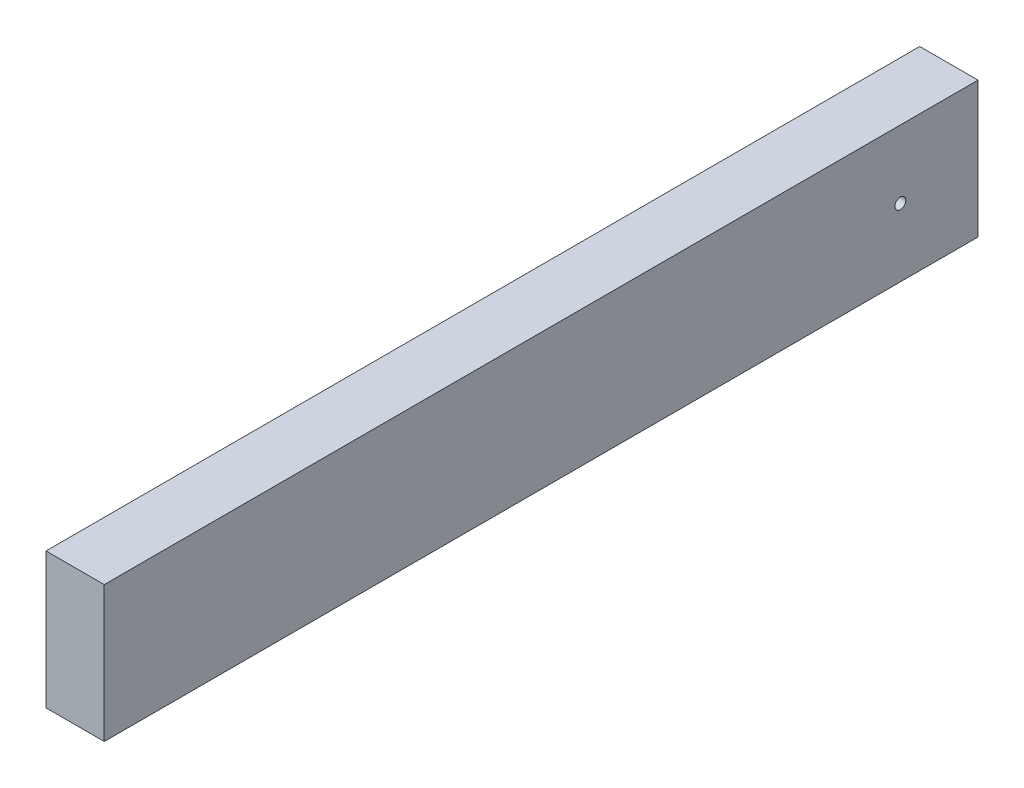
from build123d import *

# Parameters (mm, degrees)
SKETCH1_W                       = 38.1
SKETCH1_H                       = 88.9
BOSS_EXTRUDE1_DEPTH             = 571.5
F_9_32_0_28125_DIAMETER_HOLE1_D = 7.14375


with BuildPart() as part:
    # Sketch1 → Boss-Extrude1 (new body)
    with BuildSketch(Plane.XY):
        Rectangle(SKETCH1_W, SKETCH1_H)
    extrude(amount=BOSS_EXTRUDE1_DEPTH)

    # 9_32 _0.28125_ Diameter Hole1 (through all)
    with Locations(Plane(origin=(19.05, 0, 0), x_dir=(0, 0, -1), z_dir=(1, 0, 0))):
        with Locations((-50.8, 0)):
            Hole(F_9_32_0_28125_DIAMETER_HOLE1_D / 2)


solid = part.part
